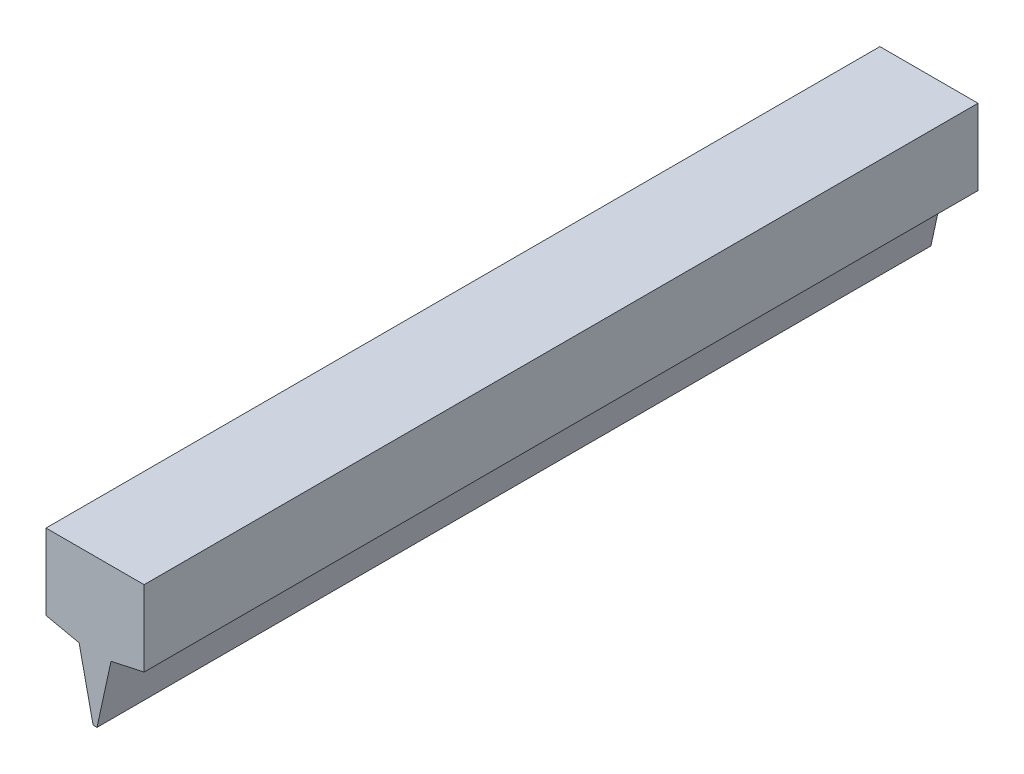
from build123d import *

# Parameters (mm, degrees)
BOSS_EXTRUDE1_DEPTH = 53.975


with BuildPart() as part:
    # Sketch1 → Boss-Extrude1 (new body)
    with BuildSketch(Plane.XY):
        Polygon((-3.175, 0), (3.175, 0), (3.175, -4.898843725), (1.031825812, -5.364997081), (0.127, -9.525), (-0.127, -9.525), (-1.031825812, -5.364997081), (-3.175, -4.898843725), align=None)
    extrude(amount=BOSS_EXTRUDE1_DEPTH)


solid = part.part
